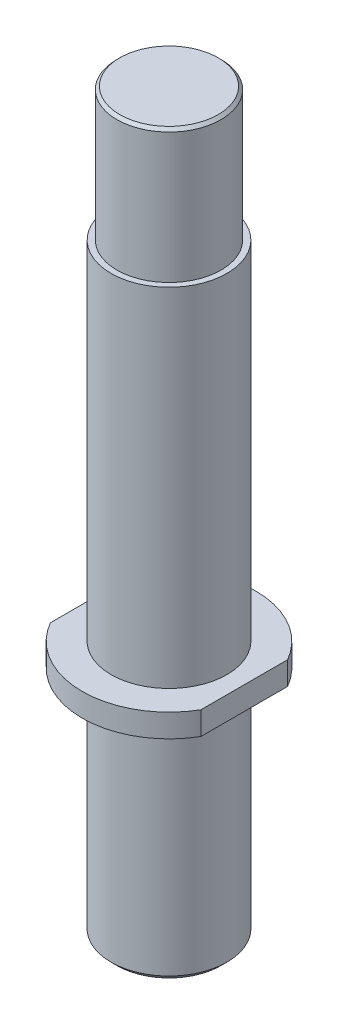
ISO-10303-21;
HEADER;
FILE_DESCRIPTION(('STEP AP214'),'2;1');
FILE_NAME('part.step','',(''),(''),'','','');
FILE_SCHEMA(('AUTOMOTIVE_DESIGN { 1 0 10303 214 1 1 1 1 }'));
ENDSEC;
DATA;
#1=APPLICATION_CONTEXT('core data for automotive mechanical design processes');
#2=APPLICATION_PROTOCOL_DEFINITION('international standard','automotive_design',2000,#1);
#3=PRODUCT_CONTEXT('',#1,'mechanical');
#4=PRODUCT('Part','Part','',(#3));
#5=PRODUCT_RELATED_PRODUCT_CATEGORY('part','',(#4));
#6=PRODUCT_DEFINITION_FORMATION('','',#4);
#7=PRODUCT_DEFINITION_CONTEXT('part definition',#1,'design');
#8=PRODUCT_DEFINITION('design','',#6,#7);
#9=PRODUCT_DEFINITION_SHAPE('','',#8);
#10=(LENGTH_UNIT() NAMED_UNIT(*) SI_UNIT(.MILLI.,.METRE.));
#11=(NAMED_UNIT(*) PLANE_ANGLE_UNIT() SI_UNIT($,.RADIAN.));
#12=(NAMED_UNIT(*) SI_UNIT($,.STERADIAN.) SOLID_ANGLE_UNIT());
#13=UNCERTAINTY_MEASURE_WITH_UNIT(LENGTH_MEASURE(1.E-05),#10,'distance_accuracy_value','');
#14=(GEOMETRIC_REPRESENTATION_CONTEXT(3) GLOBAL_UNCERTAINTY_ASSIGNED_CONTEXT((#13)) GLOBAL_UNIT_ASSIGNED_CONTEXT((#10,
#11,#12)) REPRESENTATION_CONTEXT('',''));
#15=CARTESIAN_POINT('',(0.,0.,0.));
#16=DIRECTION('',(0.,0.,1.));
#17=DIRECTION('',(1.,0.,0.));
#18=AXIS2_PLACEMENT_3D('',#15,#16,#17);
#19=CARTESIAN_POINT('',(0.,104.,0.));
#20=DIRECTION('',(0.,1.,0.));
#21=DIRECTION('',(0.,0.,1.));
#22=AXIS2_PLACEMENT_3D('',#19,#20,#21);
#23=PLANE('',#22);
#24=CARTESIAN_POINT('',(0.,104.,0.));
#25=DIRECTION('',(0.,1.,0.));
#26=DIRECTION('',(0.,0.,1.));
#27=AXIS2_PLACEMENT_3D('',#24,#25,#26);
#28=CIRCLE('',#27,10.);
#29=CARTESIAN_POINT('',(0.,104.,10.));
#30=VERTEX_POINT('',#29);
#31=EDGE_CURVE('E84',#30,#30,#28,.T.);
#32=ORIENTED_EDGE('',*,*,#31,.T.);
#33=EDGE_LOOP('',(#32));
#34=FACE_BOUND('',#33,.T.);
#35=CARTESIAN_POINT('',(0.,104.,0.));
#36=DIRECTION('',(0.,1.,0.));
#37=DIRECTION('',(0.,0.,1.));
#38=AXIS2_PLACEMENT_3D('',#35,#36,#37);
#39=CIRCLE('',#38,8.99999999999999);
#40=CARTESIAN_POINT('',(0.,104.,8.99999999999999));
#41=VERTEX_POINT('',#40);
#42=EDGE_CURVE('E311',#41,#41,#39,.T.);
#43=ORIENTED_EDGE('',*,*,#42,.F.);
#44=EDGE_LOOP('',(#43));
#45=FACE_BOUND('',#44,.T.);
#46=ADVANCED_FACE('F30',(#34,#45),#23,.T.);
#47=CARTESIAN_POINT('',(0.,44.,0.));
#48=DIRECTION('',(0.,1.,0.));
#49=DIRECTION('',(0.,0.,1.));
#50=AXIS2_PLACEMENT_3D('',#47,#48,#49);
#51=PLANE('',#50);
#52=DIRECTION('',(0.,0.,-1.));
#53=VECTOR('',#52,1.);
#54=CARTESIAN_POINT('',(-13.,44.,0.));
#55=LINE('',#54,#53);
#56=CARTESIAN_POINT('',(-13.,44.,7.48331477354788));
#57=VERTEX_POINT('',#56);
#58=CARTESIAN_POINT('',(-13.,44.,-7.48331477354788));
#59=VERTEX_POINT('',#58);
#60=EDGE_CURVE('E117',#57,#59,#55,.T.);
#61=ORIENTED_EDGE('',*,*,#60,.F.);
#62=CARTESIAN_POINT('',(0.,44.,0.));
#63=DIRECTION('',(0.,1.,0.));
#64=DIRECTION('',(0.,0.,1.));
#65=AXIS2_PLACEMENT_3D('',#62,#63,#64);
#66=CIRCLE('',#65,15.);
#67=CARTESIAN_POINT('',(13.,44.,7.48331477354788));
#68=VERTEX_POINT('',#67);
#69=EDGE_CURVE('E109',#57,#68,#66,.T.);
#70=ORIENTED_EDGE('',*,*,#69,.T.);
#71=DIRECTION('',(0.,0.,1.));
#72=VECTOR('',#71,1.);
#73=CARTESIAN_POINT('',(13.,44.,0.));
#74=LINE('',#73,#72);
#75=CARTESIAN_POINT('',(13.,44.,-7.48331477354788));
#76=VERTEX_POINT('',#75);
#77=EDGE_CURVE('E115',#76,#68,#74,.T.);
#78=ORIENTED_EDGE('',*,*,#77,.F.);
#79=EDGE_CURVE('E105',#76,#59,#66,.T.);
#80=ORIENTED_EDGE('',*,*,#79,.T.);
#81=EDGE_LOOP('',(#61,#70,#78,#80));
#82=FACE_BOUND('',#81,.T.);
#83=CARTESIAN_POINT('',(0.,44.,0.));
#84=DIRECTION('',(0.,1.,0.));
#85=DIRECTION('',(0.,0.,1.));
#86=AXIS2_PLACEMENT_3D('',#83,#84,#85);
#87=CIRCLE('',#86,10.);
#88=CARTESIAN_POINT('',(0.,44.,10.));
#89=VERTEX_POINT('',#88);
#90=EDGE_CURVE('E90',#89,#89,#87,.T.);
#91=ORIENTED_EDGE('',*,*,#90,.F.);
#92=EDGE_LOOP('',(#91));
#93=FACE_BOUND('',#92,.T.);
#94=ADVANCED_FACE('F144',(#82,#93),#51,.T.);
#95=CARTESIAN_POINT('',(0.,44.,0.));
#96=DIRECTION('',(0.,-1.,0.));
#97=DIRECTION('',(0.,0.,-1.));
#98=AXIS2_PLACEMENT_3D('',#95,#96,#97);
#99=CYLINDRICAL_SURFACE('',#98,15.);
#100=ORIENTED_EDGE('',*,*,#69,.F.);
#101=DIRECTION('',(0.,-1.,0.));
#102=VECTOR('',#101,1.);
#103=CARTESIAN_POINT('',(-13.,44.,7.48331477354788));
#104=LINE('',#103,#102);
#105=CARTESIAN_POINT('',(-13.,40.,7.48331477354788));
#106=VERTEX_POINT('',#105);
#107=EDGE_CURVE('E45',#57,#106,#104,.T.);
#108=ORIENTED_EDGE('',*,*,#107,.T.);
#109=CARTESIAN_POINT('',(0.,40.,0.));
#110=DIRECTION('',(0.,1.,0.));
#111=DIRECTION('',(0.,0.,1.));
#112=AXIS2_PLACEMENT_3D('',#109,#110,#111);
#113=CIRCLE('',#112,15.);
#114=CARTESIAN_POINT('',(13.,40.,7.48331477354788));
#115=VERTEX_POINT('',#114);
#116=EDGE_CURVE('E104',#106,#115,#113,.T.);
#117=ORIENTED_EDGE('',*,*,#116,.T.);
#118=DIRECTION('',(0.,-1.,0.));
#119=VECTOR('',#118,1.);
#120=CARTESIAN_POINT('',(13.,44.,7.48331477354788));
#121=LINE('',#120,#119);
#122=EDGE_CURVE('E100',#115,#68,#121,.F.);
#123=ORIENTED_EDGE('',*,*,#122,.T.);
#124=EDGE_LOOP('',(#100,#108,#117,#123));
#125=FACE_BOUND('',#124,.T.);
#126=ADVANCED_FACE('F150',(#125),#99,.T.);
#127=CARTESIAN_POINT('',(0.,40.,0.));
#128=DIRECTION('',(0.,-1.,0.));
#129=DIRECTION('',(0.,0.,-1.));
#130=AXIS2_PLACEMENT_3D('',#127,#128,#129);
#131=CYLINDRICAL_SURFACE('',#130,10.);
#132=CARTESIAN_POINT('',(0.,1.,0.));
#133=DIRECTION('',(0.,1.,0.));
#134=DIRECTION('',(0.,0.,1.));
#135=AXIS2_PLACEMENT_3D('',#132,#133,#134);
#136=CIRCLE('',#135,10.);
#137=CARTESIAN_POINT('',(0.,1.,10.));
#138=VERTEX_POINT('',#137);
#139=EDGE_CURVE('E119',#138,#138,#136,.T.);
#140=ORIENTED_EDGE('',*,*,#139,.T.);
#141=EDGE_LOOP('',(#140));
#142=FACE_BOUND('',#141,.T.);
#143=CARTESIAN_POINT('',(0.,40.,0.));
#144=DIRECTION('',(0.,1.,0.));
#145=DIRECTION('',(0.,0.,1.));
#146=AXIS2_PLACEMENT_3D('',#143,#144,#145);
#147=CIRCLE('',#146,10.);
#148=CARTESIAN_POINT('',(0.,40.,10.));
#149=VERTEX_POINT('',#148);
#150=EDGE_CURVE('E108',#149,#149,#147,.T.);
#151=ORIENTED_EDGE('',*,*,#150,.F.);
#152=EDGE_LOOP('',(#151));
#153=FACE_BOUND('',#152,.T.);
#154=ADVANCED_FACE('F181',(#142,#153),#131,.T.);
#155=CARTESIAN_POINT('',(0.,0.,0.));
#156=DIRECTION('',(0.,1.,0.));
#157=DIRECTION('',(0.,0.,1.));
#158=AXIS2_PLACEMENT_3D('',#155,#156,#157);
#159=PLANE('',#158);
#160=CARTESIAN_POINT('',(0.,0.,0.));
#161=DIRECTION('',(0.,1.,0.));
#162=DIRECTION('',(0.,0.,1.));
#163=AXIS2_PLACEMENT_3D('',#160,#161,#162);
#164=CIRCLE('',#163,5.5);
#165=CARTESIAN_POINT('',(0.,0.,5.5));
#166=VERTEX_POINT('',#165);
#167=EDGE_CURVE('E128',#166,#166,#164,.T.);
#168=ORIENTED_EDGE('',*,*,#167,.T.);
#169=EDGE_LOOP('',(#168));
#170=FACE_BOUND('',#169,.T.);
#171=CARTESIAN_POINT('',(0.,0.,0.));
#172=DIRECTION('',(0.,1.,0.));
#173=DIRECTION('',(0.,0.,1.));
#174=AXIS2_PLACEMENT_3D('',#171,#172,#173);
#175=CIRCLE('',#174,9.);
#176=CARTESIAN_POINT('',(0.,0.,9.));
#177=VERTEX_POINT('',#176);
#178=EDGE_CURVE('E122',#177,#177,#175,.F.);
#179=ORIENTED_EDGE('',*,*,#178,.T.);
#180=EDGE_LOOP('',(#179));
#181=FACE_BOUND('',#180,.T.);
#182=ADVANCED_FACE('F174',(#170,#181),#159,.F.);
#183=CARTESIAN_POINT('',(0.,40.,0.));
#184=DIRECTION('',(0.,1.,0.));
#185=DIRECTION('',(0.,0.,1.));
#186=AXIS2_PLACEMENT_3D('',#183,#184,#185);
#187=PLANE('',#186);
#188=ORIENTED_EDGE('',*,*,#116,.F.);
#189=DIRECTION('',(0.,0.,-1.));
#190=VECTOR('',#189,1.);
#191=CARTESIAN_POINT('',(-13.,40.,-20.9320525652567));
#192=LINE('',#191,#190);
#193=CARTESIAN_POINT('',(-13.,40.,-7.48331477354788));
#194=VERTEX_POINT('',#193);
#195=EDGE_CURVE('E83',#106,#194,#192,.T.);
#196=ORIENTED_EDGE('',*,*,#195,.T.);
#197=CARTESIAN_POINT('',(13.,40.,-7.48331477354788));
#198=VERTEX_POINT('',#197);
#199=EDGE_CURVE('E110',#198,#194,#113,.T.);
#200=ORIENTED_EDGE('',*,*,#199,.F.);
#201=DIRECTION('',(0.,0.,1.));
#202=VECTOR('',#201,1.);
#203=CARTESIAN_POINT('',(13.,40.,-20.9320525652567));
#204=LINE('',#203,#202);
#205=EDGE_CURVE('E97',#198,#115,#204,.T.);
#206=ORIENTED_EDGE('',*,*,#205,.T.);
#207=EDGE_LOOP('',(#188,#196,#200,#206));
#208=FACE_BOUND('',#207,.T.);
#209=ORIENTED_EDGE('',*,*,#150,.T.);
#210=EDGE_LOOP('',(#209));
#211=FACE_BOUND('',#210,.T.);
#212=ADVANCED_FACE('F171',(#208,#211),#187,.F.);
#213=ORIENTED_EDGE('',*,*,#199,.T.);
#214=DIRECTION('',(0.,-1.,0.));
#215=VECTOR('',#214,1.);
#216=CARTESIAN_POINT('',(-13.,44.,-7.48331477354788));
#217=LINE('',#216,#215);
#218=EDGE_CURVE('E87',#194,#59,#217,.F.);
#219=ORIENTED_EDGE('',*,*,#218,.T.);
#220=ORIENTED_EDGE('',*,*,#79,.F.);
#221=DIRECTION('',(0.,-1.,0.));
#222=VECTOR('',#221,1.);
#223=CARTESIAN_POINT('',(13.,44.,-7.48331477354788));
#224=LINE('',#223,#222);
#225=EDGE_CURVE('E53',#76,#198,#224,.T.);
#226=ORIENTED_EDGE('',*,*,#225,.T.);
#227=EDGE_LOOP('',(#213,#219,#220,#226));
#228=FACE_BOUND('',#227,.T.);
#229=ADVANCED_FACE('F169',(#228),#99,.T.);
#230=CARTESIAN_POINT('',(13.,40.,-20.9320525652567));
#231=DIRECTION('',(-1.,0.,0.));
#232=DIRECTION('',(0.,0.,1.));
#233=AXIS2_PLACEMENT_3D('',#230,#231,#232);
#234=PLANE('',#233);
#235=ORIENTED_EDGE('',*,*,#77,.T.);
#236=ORIENTED_EDGE('',*,*,#122,.F.);
#237=ORIENTED_EDGE('',*,*,#205,.F.);
#238=ORIENTED_EDGE('',*,*,#225,.F.);
#239=EDGE_LOOP('',(#235,#236,#237,#238));
#240=FACE_BOUND('',#239,.T.);
#241=ADVANCED_FACE('F167',(#240),#234,.F.);
#242=CARTESIAN_POINT('',(-13.,40.,-20.9320525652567));
#243=DIRECTION('',(1.,0.,0.));
#244=DIRECTION('',(0.,0.,-1.));
#245=AXIS2_PLACEMENT_3D('',#242,#243,#244);
#246=PLANE('',#245);
#247=ORIENTED_EDGE('',*,*,#60,.T.);
#248=ORIENTED_EDGE('',*,*,#218,.F.);
#249=ORIENTED_EDGE('',*,*,#195,.F.);
#250=ORIENTED_EDGE('',*,*,#107,.F.);
#251=EDGE_LOOP('',(#247,#248,#249,#250));
#252=FACE_BOUND('',#251,.T.);
#253=ADVANCED_FACE('F164',(#252),#246,.F.);
#254=CARTESIAN_POINT('',(0.,1.,0.));
#255=DIRECTION('',(0.,1.,0.));
#256=DIRECTION('',(0.,0.,1.));
#257=AXIS2_PLACEMENT_3D('',#254,#255,#256);
#258=CONICAL_SURFACE('',#257,10.,0.785398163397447);
#259=ORIENTED_EDGE('',*,*,#178,.F.);
#260=EDGE_LOOP('',(#259));
#261=FACE_BOUND('',#260,.T.);
#262=ORIENTED_EDGE('',*,*,#139,.F.);
#263=EDGE_LOOP('',(#262));
#264=FACE_BOUND('',#263,.T.);
#265=ADVANCED_FACE('F162',(#261,#264),#258,.T.);
#266=CARTESIAN_POINT('',(0.,34.,0.));
#267=DIRECTION('',(0.,-1.,0.));
#268=DIRECTION('',(0.,0.,-1.));
#269=AXIS2_PLACEMENT_3D('',#266,#267,#268);
#270=CYLINDRICAL_SURFACE('',#269,5.);
#271=CARTESIAN_POINT('',(0.,0.499999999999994,0.));
#272=DIRECTION('',(0.,1.,0.));
#273=DIRECTION('',(0.,0.,1.));
#274=AXIS2_PLACEMENT_3D('',#271,#272,#273);
#275=CIRCLE('',#274,5.);
#276=CARTESIAN_POINT('',(0.,0.499999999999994,5.));
#277=VERTEX_POINT('',#276);
#278=EDGE_CURVE('E125',#277,#277,#275,.F.);
#279=ORIENTED_EDGE('',*,*,#278,.T.);
#280=EDGE_LOOP('',(#279));
#281=FACE_BOUND('',#280,.T.);
#282=CARTESIAN_POINT('',(0.,34.,0.));
#283=DIRECTION('',(0.,-1.,0.));
#284=DIRECTION('',(0.,0.,-1.));
#285=AXIS2_PLACEMENT_3D('',#282,#283,#284);
#286=CIRCLE('',#285,5.);
#287=CARTESIAN_POINT('',(0.,34.,-5.));
#288=VERTEX_POINT('',#287);
#289=EDGE_CURVE('E81',#288,#288,#286,.T.);
#290=ORIENTED_EDGE('',*,*,#289,.F.);
#291=EDGE_LOOP('',(#290));
#292=FACE_BOUND('',#291,.T.);
#293=ADVANCED_FACE('F159',(#281,#292),#270,.F.);
#294=CARTESIAN_POINT('',(0.,0.499999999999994,0.));
#295=DIRECTION('',(0.,-1.,0.));
#296=DIRECTION('',(0.,0.,-1.));
#297=AXIS2_PLACEMENT_3D('',#294,#295,#296);
#298=CONICAL_SURFACE('',#297,5.,0.785398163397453);
#299=ORIENTED_EDGE('',*,*,#167,.F.);
#300=EDGE_LOOP('',(#299));
#301=FACE_BOUND('',#300,.T.);
#302=ORIENTED_EDGE('',*,*,#278,.F.);
#303=EDGE_LOOP('',(#302));
#304=FACE_BOUND('',#303,.T.);
#305=ADVANCED_FACE('F77',(#301,#304),#298,.F.);
#306=CARTESIAN_POINT('',(0.,34.,0.));
#307=DIRECTION('',(0.,-1.,0.));
#308=DIRECTION('',(0.,0.,-1.));
#309=AXIS2_PLACEMENT_3D('',#306,#307,#308);
#310=CONICAL_SURFACE('',#309,5.,1.27409035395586);
#311=CARTESIAN_POINT('',(0.,35.5286534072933,0.));
#312=VERTEX_POINT('',#311);
#313=VERTEX_LOOP('',#312);
#314=FACE_BOUND('',#313,.T.);
#315=ORIENTED_EDGE('',*,*,#289,.T.);
#316=EDGE_LOOP('',(#315));
#317=FACE_BOUND('',#316,.T.);
#318=ADVANCED_FACE('F73',(#314,#317),#310,.F.);
#319=CARTESIAN_POINT('',(0.,104.,0.));
#320=DIRECTION('',(0.,-1.,0.));
#321=DIRECTION('',(0.,0.,-1.));
#322=AXIS2_PLACEMENT_3D('',#319,#320,#321);
#323=CYLINDRICAL_SURFACE('',#322,10.);
#324=ORIENTED_EDGE('',*,*,#31,.F.);
#325=EDGE_LOOP('',(#324));
#326=FACE_BOUND('',#325,.T.);
#327=ORIENTED_EDGE('',*,*,#90,.T.);
#328=EDGE_LOOP('',(#327));
#329=FACE_BOUND('',#328,.T.);
#330=ADVANCED_FACE('F76',(#326,#329),#323,.T.);
#331=CARTESIAN_POINT('',(0.,127.,0.));
#332=DIRECTION('',(0.,-1.,0.));
#333=DIRECTION('',(0.,0.,-1.));
#334=AXIS2_PLACEMENT_3D('',#331,#332,#333);
#335=CYLINDRICAL_SURFACE('',#334,8.99999999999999);
#336=CARTESIAN_POINT('',(0.,126.5,0.));
#337=DIRECTION('',(0.,1.,0.));
#338=DIRECTION('',(0.,0.,1.));
#339=AXIS2_PLACEMENT_3D('',#336,#337,#338);
#340=CIRCLE('',#339,8.99999999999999);
#341=CARTESIAN_POINT('',(0.,126.5,8.99999999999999));
#342=VERTEX_POINT('',#341);
#343=EDGE_CURVE('E11',#342,#342,#340,.F.);
#344=ORIENTED_EDGE('',*,*,#343,.T.);
#345=EDGE_LOOP('',(#344));
#346=FACE_BOUND('',#345,.T.);
#347=ORIENTED_EDGE('',*,*,#42,.T.);
#348=EDGE_LOOP('',(#347));
#349=FACE_BOUND('',#348,.T.);
#350=ADVANCED_FACE('F140',(#346,#349),#335,.T.);
#351=CARTESIAN_POINT('',(0.,127.,0.));
#352=DIRECTION('',(0.,1.,0.));
#353=DIRECTION('',(0.,0.,1.));
#354=AXIS2_PLACEMENT_3D('',#351,#352,#353);
#355=PLANE('',#354);
#356=CARTESIAN_POINT('',(0.,127.,0.));
#357=DIRECTION('',(0.,1.,0.));
#358=DIRECTION('',(0.,0.,1.));
#359=AXIS2_PLACEMENT_3D('',#356,#357,#358);
#360=CIRCLE('',#359,8.50000000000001);
#361=CARTESIAN_POINT('',(0.,127.,8.50000000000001));
#362=VERTEX_POINT('',#361);
#363=EDGE_CURVE('E38',#362,#362,#360,.T.);
#364=ORIENTED_EDGE('',*,*,#363,.T.);
#365=EDGE_LOOP('',(#364));
#366=FACE_BOUND('',#365,.T.);
#367=ADVANCED_FACE('F133',(#366),#355,.T.);
#368=CARTESIAN_POINT('',(0.,127.,0.));
#369=DIRECTION('',(0.,-1.,0.));
#370=DIRECTION('',(0.,0.,-1.));
#371=AXIS2_PLACEMENT_3D('',#368,#369,#370);
#372=CONICAL_SURFACE('',#371,8.50000000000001,0.785398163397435);
#373=ORIENTED_EDGE('',*,*,#343,.F.);
#374=EDGE_LOOP('',(#373));
#375=FACE_BOUND('',#374,.T.);
#376=ORIENTED_EDGE('',*,*,#363,.F.);
#377=EDGE_LOOP('',(#376));
#378=FACE_BOUND('',#377,.T.);
#379=ADVANCED_FACE('F32',(#375,#378),#372,.T.);
#380=CLOSED_SHELL('',(#46,#94,#126,#154,#182,#212,#229,#241,#253,#265,#293,#305,#318,#330,#350,
#367,#379));
#381=MANIFOLD_SOLID_BREP('B2',#380);
#382=ADVANCED_BREP_SHAPE_REPRESENTATION('',(#18,#381),#14);
#383=SHAPE_DEFINITION_REPRESENTATION(#9,#382);
ENDSEC;
END-ISO-10303-21;
